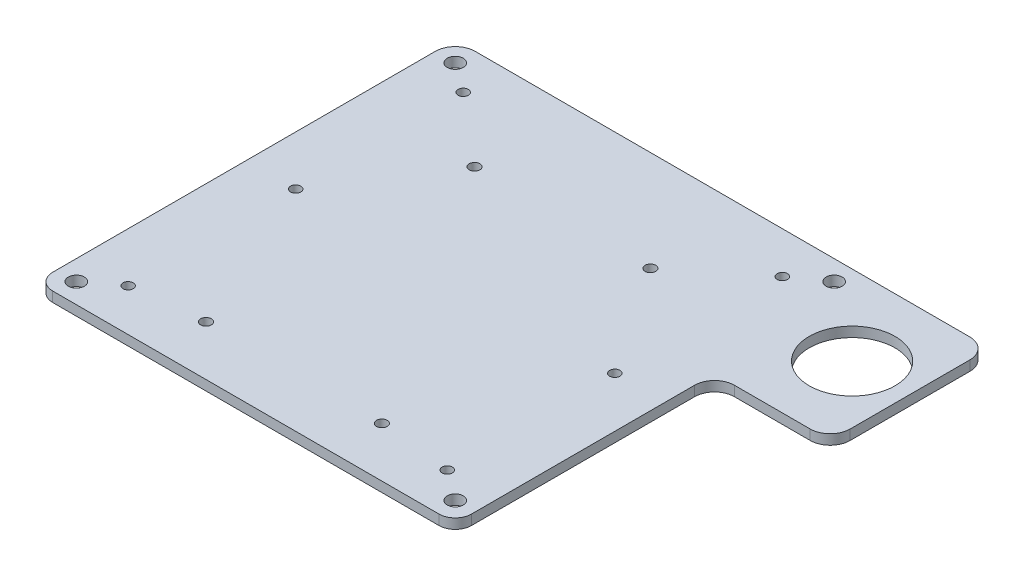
ISO-10303-21;
HEADER;
FILE_DESCRIPTION(('STEP AP214'),'2;1');
FILE_NAME('part.step','',(''),(''),'','','');
FILE_SCHEMA(('AUTOMOTIVE_DESIGN { 1 0 10303 214 1 1 1 1 }'));
ENDSEC;
DATA;
#1=APPLICATION_CONTEXT('core data for automotive mechanical design processes');
#2=APPLICATION_PROTOCOL_DEFINITION('international standard','automotive_design',2000,#1);
#3=PRODUCT_CONTEXT('',#1,'mechanical');
#4=PRODUCT('Part','Part','',(#3));
#5=PRODUCT_RELATED_PRODUCT_CATEGORY('part','',(#4));
#6=PRODUCT_DEFINITION_FORMATION('','',#4);
#7=PRODUCT_DEFINITION_CONTEXT('part definition',#1,'design');
#8=PRODUCT_DEFINITION('design','',#6,#7);
#9=PRODUCT_DEFINITION_SHAPE('','',#8);
#10=(LENGTH_UNIT() NAMED_UNIT(*) SI_UNIT(.MILLI.,.METRE.));
#11=(NAMED_UNIT(*) PLANE_ANGLE_UNIT() SI_UNIT($,.RADIAN.));
#12=(NAMED_UNIT(*) SI_UNIT($,.STERADIAN.) SOLID_ANGLE_UNIT());
#13=UNCERTAINTY_MEASURE_WITH_UNIT(LENGTH_MEASURE(1.E-05),#10,'distance_accuracy_value','');
#14=(GEOMETRIC_REPRESENTATION_CONTEXT(3) GLOBAL_UNCERTAINTY_ASSIGNED_CONTEXT((#13)) GLOBAL_UNIT_ASSIGNED_CONTEXT((#10,
#11,#12)) REPRESENTATION_CONTEXT('',''));
#15=CARTESIAN_POINT('',(0.,0.,0.));
#16=DIRECTION('',(0.,0.,1.));
#17=DIRECTION('',(1.,0.,0.));
#18=AXIS2_PLACEMENT_3D('',#15,#16,#17);
#19=CARTESIAN_POINT('',(73.025,3.175,-9.52500000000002));
#20=DIRECTION('',(0.,-1.,0.));
#21=DIRECTION('',(0.,0.,-1.));
#22=AXIS2_PLACEMENT_3D('',#19,#20,#21);
#23=CYLINDRICAL_SURFACE('',#22,6.35);
#24=CARTESIAN_POINT('',(73.025,0.,-9.52500000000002));
#25=DIRECTION('',(0.,-1.,0.));
#26=DIRECTION('',(0.,0.,1.));
#27=AXIS2_PLACEMENT_3D('',#24,#25,#26);
#28=CIRCLE('',#27,6.35);
#29=CARTESIAN_POINT('',(66.675,0.,-9.52499999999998));
#30=VERTEX_POINT('',#29);
#31=CARTESIAN_POINT('',(73.0250000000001,0.,-15.875));
#32=VERTEX_POINT('',#31);
#33=EDGE_CURVE('E156',#30,#32,#28,.T.);
#34=ORIENTED_EDGE('',*,*,#33,.T.);
#35=DIRECTION('',(0.,-1.,0.));
#36=VECTOR('',#35,1.);
#37=CARTESIAN_POINT('',(73.0250000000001,3.175,-15.875));
#38=LINE('',#37,#36);
#39=CARTESIAN_POINT('',(73.0250000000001,3.175,-15.875));
#40=VERTEX_POINT('',#39);
#41=EDGE_CURVE('E11',#40,#32,#38,.T.);
#42=ORIENTED_EDGE('',*,*,#41,.F.);
#43=CARTESIAN_POINT('',(73.025,3.175,-9.52500000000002));
#44=DIRECTION('',(0.,-1.,0.));
#45=DIRECTION('',(0.,0.,1.));
#46=AXIS2_PLACEMENT_3D('',#43,#44,#45);
#47=CIRCLE('',#46,6.35);
#48=CARTESIAN_POINT('',(66.675,3.175,-9.52499999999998));
#49=VERTEX_POINT('',#48);
#50=EDGE_CURVE('E179',#49,#40,#47,.T.);
#51=ORIENTED_EDGE('',*,*,#50,.F.);
#52=DIRECTION('',(0.,-1.,0.));
#53=VECTOR('',#52,1.);
#54=CARTESIAN_POINT('',(66.675,3.175,-9.52499999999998));
#55=LINE('',#54,#53);
#56=EDGE_CURVE('E152',#49,#30,#55,.T.);
#57=ORIENTED_EDGE('',*,*,#56,.T.);
#58=EDGE_LOOP('',(#34,#42,#51,#57));
#59=FACE_BOUND('',#58,.T.);
#60=ADVANCED_FACE('F36',(#59),#23,.F.);
#61=CARTESIAN_POINT('',(97.155,3.175,-15.875));
#62=DIRECTION('',(0.,0.,-1.));
#63=DIRECTION('',(-1.,0.,0.));
#64=AXIS2_PLACEMENT_3D('',#61,#62,#63);
#65=PLANE('',#64);
#66=DIRECTION('',(1.,0.,0.));
#67=VECTOR('',#66,1.);
#68=CARTESIAN_POINT('',(97.155,0.,-15.875));
#69=LINE('',#68,#67);
#70=CARTESIAN_POINT('',(97.155,0.,-15.875));
#71=VERTEX_POINT('',#70);
#72=EDGE_CURVE('E159',#32,#71,#69,.T.);
#73=ORIENTED_EDGE('',*,*,#72,.T.);
#74=DIRECTION('',(0.,-1.,0.));
#75=VECTOR('',#74,1.);
#76=CARTESIAN_POINT('',(97.155,3.175,-15.875));
#77=LINE('',#76,#75);
#78=CARTESIAN_POINT('',(97.155,3.175,-15.875));
#79=VERTEX_POINT('',#78);
#80=EDGE_CURVE('E44',#79,#71,#77,.T.);
#81=ORIENTED_EDGE('',*,*,#80,.F.);
#82=DIRECTION('',(1.,0.,0.));
#83=VECTOR('',#82,1.);
#84=CARTESIAN_POINT('',(97.155,3.175,-15.875));
#85=LINE('',#84,#83);
#86=EDGE_CURVE('E107',#40,#79,#85,.T.);
#87=ORIENTED_EDGE('',*,*,#86,.F.);
#88=ORIENTED_EDGE('',*,*,#41,.T.);
#89=EDGE_LOOP('',(#73,#81,#87,#88));
#90=FACE_BOUND('',#89,.T.);
#91=ADVANCED_FACE('F259',(#90),#65,.F.);
#92=CARTESIAN_POINT('',(97.155,3.175,-22.225));
#93=DIRECTION('',(0.,-1.,0.));
#94=DIRECTION('',(0.,0.,-1.));
#95=AXIS2_PLACEMENT_3D('',#92,#93,#94);
#96=CYLINDRICAL_SURFACE('',#95,6.35);
#97=CARTESIAN_POINT('',(97.155,0.,-22.225));
#98=DIRECTION('',(0.,1.,0.));
#99=DIRECTION('',(0.,0.,-1.));
#100=AXIS2_PLACEMENT_3D('',#97,#98,#99);
#101=CIRCLE('',#100,6.35);
#102=CARTESIAN_POINT('',(103.505,0.,-22.225));
#103=VERTEX_POINT('',#102);
#104=EDGE_CURVE('E162',#71,#103,#101,.T.);
#105=ORIENTED_EDGE('',*,*,#104,.T.);
#106=DIRECTION('',(0.,-1.,0.));
#107=VECTOR('',#106,1.);
#108=CARTESIAN_POINT('',(103.505,3.175,-22.225));
#109=LINE('',#108,#107);
#110=CARTESIAN_POINT('',(103.505,3.175,-22.225));
#111=VERTEX_POINT('',#110);
#112=EDGE_CURVE('E198',#111,#103,#109,.T.);
#113=ORIENTED_EDGE('',*,*,#112,.F.);
#114=CARTESIAN_POINT('',(97.155,3.175,-22.225));
#115=DIRECTION('',(0.,1.,0.));
#116=DIRECTION('',(0.,0.,-1.));
#117=AXIS2_PLACEMENT_3D('',#114,#115,#116);
#118=CIRCLE('',#117,6.35);
#119=EDGE_CURVE('E206',#79,#111,#118,.T.);
#120=ORIENTED_EDGE('',*,*,#119,.F.);
#121=ORIENTED_EDGE('',*,*,#80,.T.);
#122=EDGE_LOOP('',(#105,#113,#120,#121));
#123=FACE_BOUND('',#122,.T.);
#124=ADVANCED_FACE('F204',(#123),#96,.T.);
#125=CARTESIAN_POINT('',(103.505,3.175,-60.325));
#126=DIRECTION('',(-1.,0.,0.));
#127=DIRECTION('',(0.,0.,1.));
#128=AXIS2_PLACEMENT_3D('',#125,#126,#127);
#129=PLANE('',#128);
#130=DIRECTION('',(0.,0.,-1.));
#131=VECTOR('',#130,1.);
#132=CARTESIAN_POINT('',(103.505,0.,-60.325));
#133=LINE('',#132,#131);
#134=CARTESIAN_POINT('',(103.505,0.,-60.325));
#135=VERTEX_POINT('',#134);
#136=EDGE_CURVE('E164',#103,#135,#133,.T.);
#137=ORIENTED_EDGE('',*,*,#136,.T.);
#138=DIRECTION('',(0.,-1.,0.));
#139=VECTOR('',#138,1.);
#140=CARTESIAN_POINT('',(103.505,3.175,-60.325));
#141=LINE('',#140,#139);
#142=CARTESIAN_POINT('',(103.505,3.175,-60.325));
#143=VERTEX_POINT('',#142);
#144=EDGE_CURVE('E195',#143,#135,#141,.T.);
#145=ORIENTED_EDGE('',*,*,#144,.F.);
#146=DIRECTION('',(0.,0.,-1.));
#147=VECTOR('',#146,1.);
#148=CARTESIAN_POINT('',(103.505,3.175,-60.325));
#149=LINE('',#148,#147);
#150=EDGE_CURVE('E224',#111,#143,#149,.T.);
#151=ORIENTED_EDGE('',*,*,#150,.F.);
#152=ORIENTED_EDGE('',*,*,#112,.T.);
#153=EDGE_LOOP('',(#137,#145,#151,#152));
#154=FACE_BOUND('',#153,.T.);
#155=ADVANCED_FACE('F215',(#154),#129,.F.);
#156=CARTESIAN_POINT('',(97.155,3.175,-60.325));
#157=DIRECTION('',(0.,-1.,0.));
#158=DIRECTION('',(0.,0.,-1.));
#159=AXIS2_PLACEMENT_3D('',#156,#157,#158);
#160=CYLINDRICAL_SURFACE('',#159,6.35);
#161=CARTESIAN_POINT('',(97.155,0.,-60.325));
#162=DIRECTION('',(0.,1.,0.));
#163=DIRECTION('',(0.,0.,-1.));
#164=AXIS2_PLACEMENT_3D('',#161,#162,#163);
#165=CIRCLE('',#164,6.35);
#166=CARTESIAN_POINT('',(97.155,0.,-66.675));
#167=VERTEX_POINT('',#166);
#168=EDGE_CURVE('E166',#135,#167,#165,.T.);
#169=ORIENTED_EDGE('',*,*,#168,.T.);
#170=DIRECTION('',(0.,-1.,0.));
#171=VECTOR('',#170,1.);
#172=CARTESIAN_POINT('',(97.155,3.175,-66.675));
#173=LINE('',#172,#171);
#174=CARTESIAN_POINT('',(97.155,3.175,-66.675));
#175=VERTEX_POINT('',#174);
#176=EDGE_CURVE('E192',#175,#167,#173,.T.);
#177=ORIENTED_EDGE('',*,*,#176,.F.);
#178=CARTESIAN_POINT('',(97.155,3.175,-60.325));
#179=DIRECTION('',(0.,1.,0.));
#180=DIRECTION('',(0.,0.,-1.));
#181=AXIS2_PLACEMENT_3D('',#178,#179,#180);
#182=CIRCLE('',#181,6.35);
#183=EDGE_CURVE('E221',#143,#175,#182,.T.);
#184=ORIENTED_EDGE('',*,*,#183,.F.);
#185=ORIENTED_EDGE('',*,*,#144,.T.);
#186=EDGE_LOOP('',(#169,#177,#184,#185));
#187=FACE_BOUND('',#186,.T.);
#188=ADVANCED_FACE('F219',(#187),#160,.T.);
#189=CARTESIAN_POINT('',(-60.325,3.175,-66.675));
#190=DIRECTION('',(0.,0.,1.));
#191=DIRECTION('',(1.,0.,0.));
#192=AXIS2_PLACEMENT_3D('',#189,#190,#191);
#193=PLANE('',#192);
#194=DIRECTION('',(-1.,0.,0.));
#195=VECTOR('',#194,1.);
#196=CARTESIAN_POINT('',(-60.325,0.,-66.675));
#197=LINE('',#196,#195);
#198=CARTESIAN_POINT('',(-60.325,0.,-66.675));
#199=VERTEX_POINT('',#198);
#200=EDGE_CURVE('E168',#167,#199,#197,.T.);
#201=ORIENTED_EDGE('',*,*,#200,.T.);
#202=DIRECTION('',(0.,-1.,0.));
#203=VECTOR('',#202,1.);
#204=CARTESIAN_POINT('',(-60.325,3.175,-66.675));
#205=LINE('',#204,#203);
#206=CARTESIAN_POINT('',(-60.325,3.175,-66.675));
#207=VERTEX_POINT('',#206);
#208=EDGE_CURVE('E189',#207,#199,#205,.T.);
#209=ORIENTED_EDGE('',*,*,#208,.F.);
#210=DIRECTION('',(-1.,0.,0.));
#211=VECTOR('',#210,1.);
#212=CARTESIAN_POINT('',(-60.325,3.175,-66.675));
#213=LINE('',#212,#211);
#214=EDGE_CURVE('E223',#175,#207,#213,.T.);
#215=ORIENTED_EDGE('',*,*,#214,.F.);
#216=ORIENTED_EDGE('',*,*,#176,.T.);
#217=EDGE_LOOP('',(#201,#209,#215,#216));
#218=FACE_BOUND('',#217,.T.);
#219=ADVANCED_FACE('F272',(#218),#193,.F.);
#220=CARTESIAN_POINT('',(-60.3250000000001,3.175,-60.325));
#221=DIRECTION('',(0.,-1.,0.));
#222=DIRECTION('',(0.,0.,-1.));
#223=AXIS2_PLACEMENT_3D('',#220,#221,#222);
#224=CYLINDRICAL_SURFACE('',#223,6.35);
#225=CARTESIAN_POINT('',(-60.3250000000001,0.,-60.325));
#226=DIRECTION('',(0.,1.,0.));
#227=DIRECTION('',(0.,0.,1.));
#228=AXIS2_PLACEMENT_3D('',#225,#226,#227);
#229=CIRCLE('',#228,6.35);
#230=CARTESIAN_POINT('',(-66.6750000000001,0.,-60.325));
#231=VERTEX_POINT('',#230);
#232=EDGE_CURVE('E170',#199,#231,#229,.T.);
#233=ORIENTED_EDGE('',*,*,#232,.T.);
#234=DIRECTION('',(0.,-1.,0.));
#235=VECTOR('',#234,1.);
#236=CARTESIAN_POINT('',(-66.6750000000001,3.175,-60.325));
#237=LINE('',#236,#235);
#238=CARTESIAN_POINT('',(-66.6750000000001,3.175,-60.325));
#239=VERTEX_POINT('',#238);
#240=EDGE_CURVE('E186',#239,#231,#237,.T.);
#241=ORIENTED_EDGE('',*,*,#240,.F.);
#242=CARTESIAN_POINT('',(-60.3250000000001,3.175,-60.325));
#243=DIRECTION('',(0.,1.,0.));
#244=DIRECTION('',(0.,0.,1.));
#245=AXIS2_PLACEMENT_3D('',#242,#243,#244);
#246=CIRCLE('',#245,6.35);
#247=EDGE_CURVE('E226',#207,#239,#246,.T.);
#248=ORIENTED_EDGE('',*,*,#247,.F.);
#249=ORIENTED_EDGE('',*,*,#208,.T.);
#250=EDGE_LOOP('',(#233,#241,#248,#249));
#251=FACE_BOUND('',#250,.T.);
#252=ADVANCED_FACE('F275',(#251),#224,.T.);
#253=CARTESIAN_POINT('',(-66.6750000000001,3.175,-60.325));
#254=DIRECTION('',(1.,0.,0.));
#255=DIRECTION('',(0.,0.,-1.));
#256=AXIS2_PLACEMENT_3D('',#253,#254,#255);
#257=PLANE('',#256);
#258=DIRECTION('',(0.,0.,1.));
#259=VECTOR('',#258,1.);
#260=CARTESIAN_POINT('',(-66.6750000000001,0.,-60.325));
#261=LINE('',#260,#259);
#262=CARTESIAN_POINT('',(-66.675,0.,61.4938195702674));
#263=VERTEX_POINT('',#262);
#264=EDGE_CURVE('E172',#231,#263,#261,.T.);
#265=ORIENTED_EDGE('',*,*,#264,.T.);
#266=DIRECTION('',(0.,-1.,0.));
#267=VECTOR('',#266,1.);
#268=CARTESIAN_POINT('',(-66.675,3.175,61.4938195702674));
#269=LINE('',#268,#267);
#270=CARTESIAN_POINT('',(-66.675,3.175,61.4938195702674));
#271=VERTEX_POINT('',#270);
#272=EDGE_CURVE('E183',#271,#263,#269,.T.);
#273=ORIENTED_EDGE('',*,*,#272,.F.);
#274=DIRECTION('',(0.,0.,1.));
#275=VECTOR('',#274,1.);
#276=CARTESIAN_POINT('',(-66.6750000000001,3.175,-60.325));
#277=LINE('',#276,#275);
#278=EDGE_CURVE('E232',#239,#271,#277,.T.);
#279=ORIENTED_EDGE('',*,*,#278,.F.);
#280=ORIENTED_EDGE('',*,*,#240,.T.);
#281=EDGE_LOOP('',(#265,#273,#279,#280));
#282=FACE_BOUND('',#281,.T.);
#283=ADVANCED_FACE('F238',(#282),#257,.F.);
#284=CARTESIAN_POINT('',(-61.4938195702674,3.175,61.4938195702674));
#285=DIRECTION('',(0.,-1.,0.));
#286=DIRECTION('',(0.,0.,-1.));
#287=AXIS2_PLACEMENT_3D('',#284,#285,#286);
#288=CYLINDRICAL_SURFACE('',#287,5.18118042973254);
#289=CARTESIAN_POINT('',(-61.4938195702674,0.,61.4938195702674));
#290=DIRECTION('',(0.,1.,0.));
#291=DIRECTION('',(0.,0.,1.));
#292=AXIS2_PLACEMENT_3D('',#289,#290,#291);
#293=CIRCLE('',#292,5.18118042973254);
#294=CARTESIAN_POINT('',(-61.4938195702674,0.,66.675));
#295=VERTEX_POINT('',#294);
#296=EDGE_CURVE('E174',#263,#295,#293,.T.);
#297=ORIENTED_EDGE('',*,*,#296,.T.);
#298=DIRECTION('',(0.,-1.,0.));
#299=VECTOR('',#298,1.);
#300=CARTESIAN_POINT('',(-61.4938195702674,3.175,66.675));
#301=LINE('',#300,#299);
#302=CARTESIAN_POINT('',(-61.4938195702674,3.175,66.675));
#303=VERTEX_POINT('',#302);
#304=EDGE_CURVE('E147',#303,#295,#301,.T.);
#305=ORIENTED_EDGE('',*,*,#304,.F.);
#306=CARTESIAN_POINT('',(-61.4938195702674,3.175,61.4938195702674));
#307=DIRECTION('',(0.,1.,0.));
#308=DIRECTION('',(0.,0.,1.));
#309=AXIS2_PLACEMENT_3D('',#306,#307,#308);
#310=CIRCLE('',#309,5.18118042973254);
#311=EDGE_CURVE('E138',#271,#303,#310,.T.);
#312=ORIENTED_EDGE('',*,*,#311,.F.);
#313=ORIENTED_EDGE('',*,*,#272,.T.);
#314=EDGE_LOOP('',(#297,#305,#312,#313));
#315=FACE_BOUND('',#314,.T.);
#316=ADVANCED_FACE('F242',(#315),#288,.T.);
#317=CARTESIAN_POINT('',(-61.4938195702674,3.175,66.675));
#318=DIRECTION('',(0.,0.,-1.));
#319=DIRECTION('',(-1.,0.,0.));
#320=AXIS2_PLACEMENT_3D('',#317,#318,#319);
#321=PLANE('',#320);
#322=DIRECTION('',(1.,0.,0.));
#323=VECTOR('',#322,1.);
#324=CARTESIAN_POINT('',(-61.4938195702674,0.,66.675));
#325=LINE('',#324,#323);
#326=CARTESIAN_POINT('',(61.4938195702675,0.,66.675));
#327=VERTEX_POINT('',#326);
#328=EDGE_CURVE('E146',#295,#327,#325,.T.);
#329=ORIENTED_EDGE('',*,*,#328,.T.);
#330=DIRECTION('',(0.,-1.,0.));
#331=VECTOR('',#330,1.);
#332=CARTESIAN_POINT('',(61.4938195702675,3.175,66.675));
#333=LINE('',#332,#331);
#334=CARTESIAN_POINT('',(61.4938195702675,3.175,66.675));
#335=VERTEX_POINT('',#334);
#336=EDGE_CURVE('E143',#335,#327,#333,.T.);
#337=ORIENTED_EDGE('',*,*,#336,.F.);
#338=DIRECTION('',(1.,0.,0.));
#339=VECTOR('',#338,1.);
#340=CARTESIAN_POINT('',(-61.4938195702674,3.175,66.675));
#341=LINE('',#340,#339);
#342=EDGE_CURVE('E132',#303,#335,#341,.T.);
#343=ORIENTED_EDGE('',*,*,#342,.F.);
#344=ORIENTED_EDGE('',*,*,#304,.T.);
#345=EDGE_LOOP('',(#329,#337,#343,#344));
#346=FACE_BOUND('',#345,.T.);
#347=ADVANCED_FACE('F144',(#346),#321,.F.);
#348=CARTESIAN_POINT('',(61.4938195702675,3.175,61.4938195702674));
#349=DIRECTION('',(0.,-1.,0.));
#350=DIRECTION('',(0.,0.,-1.));
#351=AXIS2_PLACEMENT_3D('',#348,#349,#350);
#352=CYLINDRICAL_SURFACE('',#351,5.18118042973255);
#353=CARTESIAN_POINT('',(61.4938195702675,0.,61.4938195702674));
#354=DIRECTION('',(0.,1.,0.));
#355=DIRECTION('',(0.,0.,1.));
#356=AXIS2_PLACEMENT_3D('',#353,#354,#355);
#357=CIRCLE('',#356,5.18118042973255);
#358=CARTESIAN_POINT('',(66.675,0.,61.4938195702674));
#359=VERTEX_POINT('',#358);
#360=EDGE_CURVE('E93',#327,#359,#357,.T.);
#361=ORIENTED_EDGE('',*,*,#360,.T.);
#362=DIRECTION('',(0.,-1.,0.));
#363=VECTOR('',#362,1.);
#364=CARTESIAN_POINT('',(66.675,3.175,61.4938195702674));
#365=LINE('',#364,#363);
#366=CARTESIAN_POINT('',(66.675,3.175,61.4938195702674));
#367=VERTEX_POINT('',#366);
#368=EDGE_CURVE('E148',#367,#359,#365,.T.);
#369=ORIENTED_EDGE('',*,*,#368,.F.);
#370=CARTESIAN_POINT('',(61.4938195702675,3.175,61.4938195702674));
#371=DIRECTION('',(0.,1.,0.));
#372=DIRECTION('',(0.,0.,1.));
#373=AXIS2_PLACEMENT_3D('',#370,#371,#372);
#374=CIRCLE('',#373,5.18118042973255);
#375=EDGE_CURVE('E136',#335,#367,#374,.T.);
#376=ORIENTED_EDGE('',*,*,#375,.F.);
#377=ORIENTED_EDGE('',*,*,#336,.T.);
#378=EDGE_LOOP('',(#361,#369,#376,#377));
#379=FACE_BOUND('',#378,.T.);
#380=ADVANCED_FACE('F150',(#379),#352,.T.);
#381=CARTESIAN_POINT('',(66.675,3.175,-9.52499999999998));
#382=DIRECTION('',(-1.,0.,0.));
#383=DIRECTION('',(0.,0.,1.));
#384=AXIS2_PLACEMENT_3D('',#381,#382,#383);
#385=PLANE('',#384);
#386=DIRECTION('',(0.,0.,-1.));
#387=VECTOR('',#386,1.);
#388=CARTESIAN_POINT('',(66.675,0.,-9.52499999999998));
#389=LINE('',#388,#387);
#390=EDGE_CURVE('E99',#359,#30,#389,.T.);
#391=ORIENTED_EDGE('',*,*,#390,.T.);
#392=ORIENTED_EDGE('',*,*,#56,.F.);
#393=DIRECTION('',(0.,0.,-1.));
#394=VECTOR('',#393,1.);
#395=CARTESIAN_POINT('',(66.675,3.175,-9.52499999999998));
#396=LINE('',#395,#394);
#397=EDGE_CURVE('E52',#367,#49,#396,.T.);
#398=ORIENTED_EDGE('',*,*,#397,.F.);
#399=ORIENTED_EDGE('',*,*,#368,.T.);
#400=EDGE_LOOP('',(#391,#392,#398,#399));
#401=FACE_BOUND('',#400,.T.);
#402=ADVANCED_FACE('F246',(#401),#385,.F.);
#403=CARTESIAN_POINT('',(73.025,3.175,-9.52500000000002));
#404=DIRECTION('',(0.,1.,0.));
#405=DIRECTION('',(0.,0.,1.));
#406=AXIS2_PLACEMENT_3D('',#403,#404,#405);
#407=PLANE('',#406);
#408=CARTESIAN_POINT('',(85.09,3.175,-41.275));
#409=DIRECTION('',(0.,1.,0.));
#410=DIRECTION('',(0.,0.,1.));
#411=AXIS2_PLACEMENT_3D('',#408,#409,#410);
#412=CIRCLE('',#411,13.6525);
#413=CARTESIAN_POINT('',(85.09,3.175,-27.6225));
#414=VERTEX_POINT('',#413);
#415=EDGE_CURVE('E466',#414,#414,#412,.T.);
#416=ORIENTED_EDGE('',*,*,#415,.F.);
#417=EDGE_LOOP('',(#416));
#418=FACE_BOUND('',#417,.T.);
#419=CARTESIAN_POINT('',(-50.927,3.175,53.213));
#420=DIRECTION('',(0.,-1.,0.));
#421=DIRECTION('',(0.,0.,-1.));
#422=AXIS2_PLACEMENT_3D('',#419,#420,#421);
#423=CIRCLE('',#422,1.63195);
#424=CARTESIAN_POINT('',(-50.927,3.175,51.58105));
#425=VERTEX_POINT('',#424);
#426=EDGE_CURVE('E473',#425,#425,#423,.T.);
#427=ORIENTED_EDGE('',*,*,#426,.T.);
#428=EDGE_LOOP('',(#427));
#429=FACE_BOUND('',#428,.T.);
#430=CARTESIAN_POINT('',(50.673,3.175,53.213));
#431=DIRECTION('',(0.,-1.,0.));
#432=DIRECTION('',(0.,0.,-1.));
#433=AXIS2_PLACEMENT_3D('',#430,#431,#432);
#434=CIRCLE('',#433,1.63195);
#435=CARTESIAN_POINT('',(50.673,3.175,51.58105));
#436=VERTEX_POINT('',#435);
#437=EDGE_CURVE('E479',#436,#436,#434,.T.);
#438=ORIENTED_EDGE('',*,*,#437,.T.);
#439=EDGE_LOOP('',(#438));
#440=FACE_BOUND('',#439,.T.);
#441=CARTESIAN_POINT('',(50.673,3.175,-53.467));
#442=DIRECTION('',(0.,-1.,0.));
#443=DIRECTION('',(0.,0.,-1.));
#444=AXIS2_PLACEMENT_3D('',#441,#442,#443);
#445=CIRCLE('',#444,1.63195);
#446=CARTESIAN_POINT('',(50.673,3.175,-55.09895));
#447=VERTEX_POINT('',#446);
#448=EDGE_CURVE('E485',#447,#447,#445,.T.);
#449=ORIENTED_EDGE('',*,*,#448,.T.);
#450=EDGE_LOOP('',(#449));
#451=FACE_BOUND('',#450,.T.);
#452=CARTESIAN_POINT('',(-50.927,3.175,-53.467));
#453=DIRECTION('',(0.,-1.,0.));
#454=DIRECTION('',(0.,0.,-1.));
#455=AXIS2_PLACEMENT_3D('',#452,#453,#454);
#456=CIRCLE('',#455,1.63195);
#457=CARTESIAN_POINT('',(-50.927,3.175,-55.09895));
#458=VERTEX_POINT('',#457);
#459=EDGE_CURVE('E491',#458,#458,#456,.T.);
#460=ORIENTED_EDGE('',*,*,#459,.T.);
#461=EDGE_LOOP('',(#460));
#462=FACE_BOUND('',#461,.T.);
#463=CARTESIAN_POINT('',(-50.927,3.175,-0.127000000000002));
#464=DIRECTION('',(0.,-1.,0.));
#465=DIRECTION('',(0.,0.,-1.));
#466=AXIS2_PLACEMENT_3D('',#463,#464,#465);
#467=CIRCLE('',#466,1.63195);
#468=CARTESIAN_POINT('',(-50.927,3.175,-1.75895));
#469=VERTEX_POINT('',#468);
#470=EDGE_CURVE('E497',#469,#469,#467,.T.);
#471=ORIENTED_EDGE('',*,*,#470,.T.);
#472=EDGE_LOOP('',(#471));
#473=FACE_BOUND('',#472,.T.);
#474=CARTESIAN_POINT('',(50.673,3.175,-0.127000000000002));
#475=DIRECTION('',(0.,-1.,0.));
#476=DIRECTION('',(0.,0.,-1.));
#477=AXIS2_PLACEMENT_3D('',#474,#475,#476);
#478=CIRCLE('',#477,1.63195);
#479=CARTESIAN_POINT('',(50.673,3.175,-1.75895));
#480=VERTEX_POINT('',#479);
#481=EDGE_CURVE('E503',#480,#480,#478,.T.);
#482=ORIENTED_EDGE('',*,*,#481,.T.);
#483=EDGE_LOOP('',(#482));
#484=FACE_BOUND('',#483,.T.);
#485=CARTESIAN_POINT('',(-60.325,3.175,-60.325));
#486=DIRECTION('',(0.,1.,0.));
#487=DIRECTION('',(0.,0.,1.));
#488=AXIS2_PLACEMENT_3D('',#485,#486,#487);
#489=CIRCLE('',#488,2.5527);
#490=CARTESIAN_POINT('',(-60.325,3.175,-57.7723));
#491=VERTEX_POINT('',#490);
#492=EDGE_CURVE('E506',#491,#491,#489,.T.);
#493=ORIENTED_EDGE('',*,*,#492,.F.);
#494=EDGE_LOOP('',(#493));
#495=FACE_BOUND('',#494,.T.);
#496=CARTESIAN_POINT('',(60.325,3.175,-60.325));
#497=DIRECTION('',(0.,1.,0.));
#498=DIRECTION('',(0.,0.,1.));
#499=AXIS2_PLACEMENT_3D('',#496,#497,#498);
#500=CIRCLE('',#499,2.5527);
#501=CARTESIAN_POINT('',(60.325,3.175,-57.7723));
#502=VERTEX_POINT('',#501);
#503=EDGE_CURVE('E512',#502,#502,#500,.T.);
#504=ORIENTED_EDGE('',*,*,#503,.F.);
#505=EDGE_LOOP('',(#504));
#506=FACE_BOUND('',#505,.T.);
#507=CARTESIAN_POINT('',(60.3250000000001,3.175,60.325));
#508=DIRECTION('',(0.,1.,0.));
#509=DIRECTION('',(0.,0.,1.));
#510=AXIS2_PLACEMENT_3D('',#507,#508,#509);
#511=CIRCLE('',#510,2.5527);
#512=CARTESIAN_POINT('',(60.3250000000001,3.175,62.8777));
#513=VERTEX_POINT('',#512);
#514=EDGE_CURVE('E518',#513,#513,#511,.T.);
#515=ORIENTED_EDGE('',*,*,#514,.F.);
#516=EDGE_LOOP('',(#515));
#517=FACE_BOUND('',#516,.T.);
#518=CARTESIAN_POINT('',(-60.325,3.175,60.325));
#519=DIRECTION('',(0.,1.,0.));
#520=DIRECTION('',(0.,0.,1.));
#521=AXIS2_PLACEMENT_3D('',#518,#519,#520);
#522=CIRCLE('',#521,2.5527);
#523=CARTESIAN_POINT('',(-60.325,3.175,62.8777));
#524=VERTEX_POINT('',#523);
#525=EDGE_CURVE('E524',#524,#524,#522,.T.);
#526=ORIENTED_EDGE('',*,*,#525,.F.);
#527=EDGE_LOOP('',(#526));
#528=FACE_BOUND('',#527,.T.);
#529=CARTESIAN_POINT('',(-28.5897,3.175,-34.73479995));
#530=DIRECTION('',(0.,-1.,0.));
#531=DIRECTION('',(0.,0.,-1.));
#532=AXIS2_PLACEMENT_3D('',#529,#530,#531);
#533=CIRCLE('',#532,1.7);
#534=CARTESIAN_POINT('',(-28.5897,3.175,-36.43479995));
#535=VERTEX_POINT('',#534);
#536=EDGE_CURVE('E533',#535,#535,#533,.T.);
#537=ORIENTED_EDGE('',*,*,#536,.T.);
#538=EDGE_LOOP('',(#537));
#539=FACE_BOUND('',#538,.T.);
#540=CARTESIAN_POINT('',(27.4103,3.175,-34.73479995));
#541=DIRECTION('',(0.,-1.,0.));
#542=DIRECTION('',(0.,0.,-1.));
#543=AXIS2_PLACEMENT_3D('',#540,#541,#542);
#544=CIRCLE('',#543,1.7);
#545=CARTESIAN_POINT('',(27.4103,3.175,-36.43479995));
#546=VERTEX_POINT('',#545);
#547=EDGE_CURVE('E539',#546,#546,#544,.T.);
#548=ORIENTED_EDGE('',*,*,#547,.T.);
#549=EDGE_LOOP('',(#548));
#550=FACE_BOUND('',#549,.T.);
#551=CARTESIAN_POINT('',(-28.5897,3.175,50.76520005));
#552=DIRECTION('',(0.,-1.,0.));
#553=DIRECTION('',(0.,0.,-1.));
#554=AXIS2_PLACEMENT_3D('',#551,#552,#553);
#555=CIRCLE('',#554,1.7);
#556=CARTESIAN_POINT('',(-28.5897,3.175,49.06520005));
#557=VERTEX_POINT('',#556);
#558=EDGE_CURVE('E545',#557,#557,#555,.T.);
#559=ORIENTED_EDGE('',*,*,#558,.T.);
#560=EDGE_LOOP('',(#559));
#561=FACE_BOUND('',#560,.T.);
#562=CARTESIAN_POINT('',(27.4103,3.175,50.76520005));
#563=DIRECTION('',(0.,-1.,0.));
#564=DIRECTION('',(0.,0.,-1.));
#565=AXIS2_PLACEMENT_3D('',#562,#563,#564);
#566=CIRCLE('',#565,1.7);
#567=CARTESIAN_POINT('',(27.4103,3.175,49.06520005));
#568=VERTEX_POINT('',#567);
#569=EDGE_CURVE('E160',#568,#568,#566,.T.);
#570=ORIENTED_EDGE('',*,*,#569,.T.);
#571=EDGE_LOOP('',(#570));
#572=FACE_BOUND('',#571,.T.);
#573=ORIENTED_EDGE('',*,*,#50,.T.);
#574=ORIENTED_EDGE('',*,*,#86,.T.);
#575=ORIENTED_EDGE('',*,*,#119,.T.);
#576=ORIENTED_EDGE('',*,*,#150,.T.);
#577=ORIENTED_EDGE('',*,*,#183,.T.);
#578=ORIENTED_EDGE('',*,*,#214,.T.);
#579=ORIENTED_EDGE('',*,*,#247,.T.);
#580=ORIENTED_EDGE('',*,*,#278,.T.);
#581=ORIENTED_EDGE('',*,*,#311,.T.);
#582=ORIENTED_EDGE('',*,*,#342,.T.);
#583=ORIENTED_EDGE('',*,*,#375,.T.);
#584=ORIENTED_EDGE('',*,*,#397,.T.);
#585=EDGE_LOOP('',(#573,#574,#575,#576,#577,#578,#579,#580,#581,#582,#583,#584));
#586=FACE_BOUND('',#585,.T.);
#587=ADVANCED_FACE('F134',(#418,#429,#440,#451,#462,#473,#484,#495,#506,#517,#528,#539,#550,
#561,#572,#586),#407,.T.);
#588=CARTESIAN_POINT('',(73.025,0.,-9.52500000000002));
#589=DIRECTION('',(0.,1.,0.));
#590=DIRECTION('',(0.,0.,1.));
#591=AXIS2_PLACEMENT_3D('',#588,#589,#590);
#592=PLANE('',#591);
#593=CARTESIAN_POINT('',(85.09,0.,-41.275));
#594=DIRECTION('',(0.,1.,0.));
#595=DIRECTION('',(0.,0.,1.));
#596=AXIS2_PLACEMENT_3D('',#593,#594,#595);
#597=CIRCLE('',#596,13.6525);
#598=CARTESIAN_POINT('',(85.09,0.,-27.6225));
#599=VERTEX_POINT('',#598);
#600=EDGE_CURVE('E463',#599,#599,#597,.T.);
#601=ORIENTED_EDGE('',*,*,#600,.T.);
#602=EDGE_LOOP('',(#601));
#603=FACE_BOUND('',#602,.T.);
#604=CARTESIAN_POINT('',(-50.927,0.,53.213));
#605=DIRECTION('',(0.,-1.,0.));
#606=DIRECTION('',(0.,0.,-1.));
#607=AXIS2_PLACEMENT_3D('',#604,#605,#606);
#608=CIRCLE('',#607,1.63195);
#609=CARTESIAN_POINT('',(-50.927,0.,51.58105));
#610=VERTEX_POINT('',#609);
#611=EDGE_CURVE('E468',#610,#610,#608,.T.);
#612=ORIENTED_EDGE('',*,*,#611,.F.);
#613=EDGE_LOOP('',(#612));
#614=FACE_BOUND('',#613,.T.);
#615=CARTESIAN_POINT('',(50.673,0.,53.213));
#616=DIRECTION('',(0.,-1.,0.));
#617=DIRECTION('',(0.,0.,-1.));
#618=AXIS2_PLACEMENT_3D('',#615,#616,#617);
#619=CIRCLE('',#618,1.63195);
#620=CARTESIAN_POINT('',(50.673,0.,51.58105));
#621=VERTEX_POINT('',#620);
#622=EDGE_CURVE('E476',#621,#621,#619,.T.);
#623=ORIENTED_EDGE('',*,*,#622,.F.);
#624=EDGE_LOOP('',(#623));
#625=FACE_BOUND('',#624,.T.);
#626=CARTESIAN_POINT('',(50.673,0.,-53.467));
#627=DIRECTION('',(0.,-1.,0.));
#628=DIRECTION('',(0.,0.,-1.));
#629=AXIS2_PLACEMENT_3D('',#626,#627,#628);
#630=CIRCLE('',#629,1.63195);
#631=CARTESIAN_POINT('',(50.673,0.,-55.09895));
#632=VERTEX_POINT('',#631);
#633=EDGE_CURVE('E482',#632,#632,#630,.T.);
#634=ORIENTED_EDGE('',*,*,#633,.F.);
#635=EDGE_LOOP('',(#634));
#636=FACE_BOUND('',#635,.T.);
#637=CARTESIAN_POINT('',(-50.927,0.,-53.467));
#638=DIRECTION('',(0.,-1.,0.));
#639=DIRECTION('',(0.,0.,-1.));
#640=AXIS2_PLACEMENT_3D('',#637,#638,#639);
#641=CIRCLE('',#640,1.63195);
#642=CARTESIAN_POINT('',(-50.927,0.,-55.09895));
#643=VERTEX_POINT('',#642);
#644=EDGE_CURVE('E488',#643,#643,#641,.T.);
#645=ORIENTED_EDGE('',*,*,#644,.F.);
#646=EDGE_LOOP('',(#645));
#647=FACE_BOUND('',#646,.T.);
#648=CARTESIAN_POINT('',(-50.927,0.,-0.127000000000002));
#649=DIRECTION('',(0.,-1.,0.));
#650=DIRECTION('',(0.,0.,-1.));
#651=AXIS2_PLACEMENT_3D('',#648,#649,#650);
#652=CIRCLE('',#651,1.63195);
#653=CARTESIAN_POINT('',(-50.927,0.,-1.75895));
#654=VERTEX_POINT('',#653);
#655=EDGE_CURVE('E494',#654,#654,#652,.T.);
#656=ORIENTED_EDGE('',*,*,#655,.F.);
#657=EDGE_LOOP('',(#656));
#658=FACE_BOUND('',#657,.T.);
#659=CARTESIAN_POINT('',(50.673,0.,-0.127000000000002));
#660=DIRECTION('',(0.,-1.,0.));
#661=DIRECTION('',(0.,0.,-1.));
#662=AXIS2_PLACEMENT_3D('',#659,#660,#661);
#663=CIRCLE('',#662,1.63195);
#664=CARTESIAN_POINT('',(50.673,0.,-1.75895));
#665=VERTEX_POINT('',#664);
#666=EDGE_CURVE('E500',#665,#665,#663,.T.);
#667=ORIENTED_EDGE('',*,*,#666,.F.);
#668=EDGE_LOOP('',(#667));
#669=FACE_BOUND('',#668,.T.);
#670=CARTESIAN_POINT('',(-60.325,0.,-60.325));
#671=DIRECTION('',(0.,1.,0.));
#672=DIRECTION('',(0.,0.,1.));
#673=AXIS2_PLACEMENT_3D('',#670,#671,#672);
#674=CIRCLE('',#673,2.5527);
#675=CARTESIAN_POINT('',(-60.325,0.,-57.7723));
#676=VERTEX_POINT('',#675);
#677=EDGE_CURVE('E509',#676,#676,#674,.T.);
#678=ORIENTED_EDGE('',*,*,#677,.T.);
#679=EDGE_LOOP('',(#678));
#680=FACE_BOUND('',#679,.T.);
#681=CARTESIAN_POINT('',(60.325,0.,-60.325));
#682=DIRECTION('',(0.,1.,0.));
#683=DIRECTION('',(0.,0.,1.));
#684=AXIS2_PLACEMENT_3D('',#681,#682,#683);
#685=CIRCLE('',#684,2.5527);
#686=CARTESIAN_POINT('',(60.325,0.,-57.7723));
#687=VERTEX_POINT('',#686);
#688=EDGE_CURVE('E515',#687,#687,#685,.T.);
#689=ORIENTED_EDGE('',*,*,#688,.T.);
#690=EDGE_LOOP('',(#689));
#691=FACE_BOUND('',#690,.T.);
#692=CARTESIAN_POINT('',(60.3250000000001,0.,60.325));
#693=DIRECTION('',(0.,1.,0.));
#694=DIRECTION('',(0.,0.,1.));
#695=AXIS2_PLACEMENT_3D('',#692,#693,#694);
#696=CIRCLE('',#695,2.5527);
#697=CARTESIAN_POINT('',(60.3250000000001,0.,62.8777));
#698=VERTEX_POINT('',#697);
#699=EDGE_CURVE('E521',#698,#698,#696,.T.);
#700=ORIENTED_EDGE('',*,*,#699,.T.);
#701=EDGE_LOOP('',(#700));
#702=FACE_BOUND('',#701,.T.);
#703=CARTESIAN_POINT('',(-60.325,0.,60.325));
#704=DIRECTION('',(0.,1.,0.));
#705=DIRECTION('',(0.,0.,1.));
#706=AXIS2_PLACEMENT_3D('',#703,#704,#705);
#707=CIRCLE('',#706,2.5527);
#708=CARTESIAN_POINT('',(-60.325,0.,62.8777));
#709=VERTEX_POINT('',#708);
#710=EDGE_CURVE('E527',#709,#709,#707,.T.);
#711=ORIENTED_EDGE('',*,*,#710,.T.);
#712=EDGE_LOOP('',(#711));
#713=FACE_BOUND('',#712,.T.);
#714=CARTESIAN_POINT('',(-28.5897,0.,-34.73479995));
#715=DIRECTION('',(0.,-1.,0.));
#716=DIRECTION('',(0.,0.,-1.));
#717=AXIS2_PLACEMENT_3D('',#714,#715,#716);
#718=CIRCLE('',#717,1.7);
#719=CARTESIAN_POINT('',(-28.5897,0.,-36.43479995));
#720=VERTEX_POINT('',#719);
#721=EDGE_CURVE('E530',#720,#720,#718,.T.);
#722=ORIENTED_EDGE('',*,*,#721,.F.);
#723=EDGE_LOOP('',(#722));
#724=FACE_BOUND('',#723,.T.);
#725=CARTESIAN_POINT('',(27.4103,0.,-34.73479995));
#726=DIRECTION('',(0.,-1.,0.));
#727=DIRECTION('',(0.,0.,-1.));
#728=AXIS2_PLACEMENT_3D('',#725,#726,#727);
#729=CIRCLE('',#728,1.7);
#730=CARTESIAN_POINT('',(27.4103,0.,-36.43479995));
#731=VERTEX_POINT('',#730);
#732=EDGE_CURVE('E536',#731,#731,#729,.T.);
#733=ORIENTED_EDGE('',*,*,#732,.F.);
#734=EDGE_LOOP('',(#733));
#735=FACE_BOUND('',#734,.T.);
#736=CARTESIAN_POINT('',(-28.5897,0.,50.76520005));
#737=DIRECTION('',(0.,-1.,0.));
#738=DIRECTION('',(0.,0.,-1.));
#739=AXIS2_PLACEMENT_3D('',#736,#737,#738);
#740=CIRCLE('',#739,1.7);
#741=CARTESIAN_POINT('',(-28.5897,0.,49.06520005));
#742=VERTEX_POINT('',#741);
#743=EDGE_CURVE('E542',#742,#742,#740,.T.);
#744=ORIENTED_EDGE('',*,*,#743,.F.);
#745=EDGE_LOOP('',(#744));
#746=FACE_BOUND('',#745,.T.);
#747=CARTESIAN_POINT('',(27.4103,0.,50.76520005));
#748=DIRECTION('',(0.,-1.,0.));
#749=DIRECTION('',(0.,0.,-1.));
#750=AXIS2_PLACEMENT_3D('',#747,#748,#749);
#751=CIRCLE('',#750,1.7);
#752=CARTESIAN_POINT('',(27.4103,0.,49.06520005));
#753=VERTEX_POINT('',#752);
#754=EDGE_CURVE('E548',#753,#753,#751,.T.);
#755=ORIENTED_EDGE('',*,*,#754,.F.);
#756=EDGE_LOOP('',(#755));
#757=FACE_BOUND('',#756,.T.);
#758=ORIENTED_EDGE('',*,*,#33,.F.);
#759=ORIENTED_EDGE('',*,*,#390,.F.);
#760=ORIENTED_EDGE('',*,*,#360,.F.);
#761=ORIENTED_EDGE('',*,*,#328,.F.);
#762=ORIENTED_EDGE('',*,*,#296,.F.);
#763=ORIENTED_EDGE('',*,*,#264,.F.);
#764=ORIENTED_EDGE('',*,*,#232,.F.);
#765=ORIENTED_EDGE('',*,*,#200,.F.);
#766=ORIENTED_EDGE('',*,*,#168,.F.);
#767=ORIENTED_EDGE('',*,*,#136,.F.);
#768=ORIENTED_EDGE('',*,*,#104,.F.);
#769=ORIENTED_EDGE('',*,*,#72,.F.);
#770=EDGE_LOOP('',(#758,#759,#760,#761,#762,#763,#764,#765,#766,#767,#768,#769));
#771=FACE_BOUND('',#770,.T.);
#772=ADVANCED_FACE('F210',(#603,#614,#625,#636,#647,#658,#669,#680,#691,#702,#713,#724,#735,
#746,#757,#771),#592,.F.);
#773=CARTESIAN_POINT('',(27.4103,0.,50.76520005));
#774=DIRECTION('',(0.,-1.,0.));
#775=DIRECTION('',(0.,0.,-1.));
#776=AXIS2_PLACEMENT_3D('',#773,#774,#775);
#777=CYLINDRICAL_SURFACE('',#776,1.7);
#778=ORIENTED_EDGE('',*,*,#569,.F.);
#779=EDGE_LOOP('',(#778));
#780=FACE_BOUND('',#779,.T.);
#781=ORIENTED_EDGE('',*,*,#754,.T.);
#782=EDGE_LOOP('',(#781));
#783=FACE_BOUND('',#782,.T.);
#784=ADVANCED_FACE('F303',(#780,#783),#777,.F.);
#785=CARTESIAN_POINT('',(-28.5897,0.,50.76520005));
#786=DIRECTION('',(0.,-1.,0.));
#787=DIRECTION('',(0.,0.,-1.));
#788=AXIS2_PLACEMENT_3D('',#785,#786,#787);
#789=CYLINDRICAL_SURFACE('',#788,1.7);
#790=ORIENTED_EDGE('',*,*,#558,.F.);
#791=EDGE_LOOP('',(#790));
#792=FACE_BOUND('',#791,.T.);
#793=ORIENTED_EDGE('',*,*,#743,.T.);
#794=EDGE_LOOP('',(#793));
#795=FACE_BOUND('',#794,.T.);
#796=ADVANCED_FACE('F308',(#792,#795),#789,.F.);
#797=CARTESIAN_POINT('',(27.4103,0.,-34.73479995));
#798=DIRECTION('',(0.,-1.,0.));
#799=DIRECTION('',(0.,0.,-1.));
#800=AXIS2_PLACEMENT_3D('',#797,#798,#799);
#801=CYLINDRICAL_SURFACE('',#800,1.7);
#802=ORIENTED_EDGE('',*,*,#547,.F.);
#803=EDGE_LOOP('',(#802));
#804=FACE_BOUND('',#803,.T.);
#805=ORIENTED_EDGE('',*,*,#732,.T.);
#806=EDGE_LOOP('',(#805));
#807=FACE_BOUND('',#806,.T.);
#808=ADVANCED_FACE('F320',(#804,#807),#801,.F.);
#809=CARTESIAN_POINT('',(-28.5897,0.,-34.73479995));
#810=DIRECTION('',(0.,-1.,0.));
#811=DIRECTION('',(0.,0.,-1.));
#812=AXIS2_PLACEMENT_3D('',#809,#810,#811);
#813=CYLINDRICAL_SURFACE('',#812,1.7);
#814=ORIENTED_EDGE('',*,*,#536,.F.);
#815=EDGE_LOOP('',(#814));
#816=FACE_BOUND('',#815,.T.);
#817=ORIENTED_EDGE('',*,*,#721,.T.);
#818=EDGE_LOOP('',(#817));
#819=FACE_BOUND('',#818,.T.);
#820=ADVANCED_FACE('F330',(#816,#819),#813,.F.);
#821=CARTESIAN_POINT('',(-60.325,3.175,60.325));
#822=DIRECTION('',(0.,1.,0.));
#823=DIRECTION('',(0.,0.,1.));
#824=AXIS2_PLACEMENT_3D('',#821,#822,#823);
#825=CYLINDRICAL_SURFACE('',#824,2.5527);
#826=ORIENTED_EDGE('',*,*,#710,.F.);
#827=EDGE_LOOP('',(#826));
#828=FACE_BOUND('',#827,.T.);
#829=ORIENTED_EDGE('',*,*,#525,.T.);
#830=EDGE_LOOP('',(#829));
#831=FACE_BOUND('',#830,.T.);
#832=ADVANCED_FACE('F340',(#828,#831),#825,.F.);
#833=CARTESIAN_POINT('',(60.3250000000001,3.175,60.325));
#834=DIRECTION('',(0.,1.,0.));
#835=DIRECTION('',(0.,0.,1.));
#836=AXIS2_PLACEMENT_3D('',#833,#834,#835);
#837=CYLINDRICAL_SURFACE('',#836,2.5527);
#838=ORIENTED_EDGE('',*,*,#699,.F.);
#839=EDGE_LOOP('',(#838));
#840=FACE_BOUND('',#839,.T.);
#841=ORIENTED_EDGE('',*,*,#514,.T.);
#842=EDGE_LOOP('',(#841));
#843=FACE_BOUND('',#842,.T.);
#844=ADVANCED_FACE('F350',(#840,#843),#837,.F.);
#845=CARTESIAN_POINT('',(60.325,3.175,-60.325));
#846=DIRECTION('',(0.,1.,0.));
#847=DIRECTION('',(0.,0.,1.));
#848=AXIS2_PLACEMENT_3D('',#845,#846,#847);
#849=CYLINDRICAL_SURFACE('',#848,2.5527);
#850=ORIENTED_EDGE('',*,*,#688,.F.);
#851=EDGE_LOOP('',(#850));
#852=FACE_BOUND('',#851,.T.);
#853=ORIENTED_EDGE('',*,*,#503,.T.);
#854=EDGE_LOOP('',(#853));
#855=FACE_BOUND('',#854,.T.);
#856=ADVANCED_FACE('F360',(#852,#855),#849,.F.);
#857=CARTESIAN_POINT('',(-60.325,3.175,-60.325));
#858=DIRECTION('',(0.,1.,0.));
#859=DIRECTION('',(0.,0.,1.));
#860=AXIS2_PLACEMENT_3D('',#857,#858,#859);
#861=CYLINDRICAL_SURFACE('',#860,2.5527);
#862=ORIENTED_EDGE('',*,*,#677,.F.);
#863=EDGE_LOOP('',(#862));
#864=FACE_BOUND('',#863,.T.);
#865=ORIENTED_EDGE('',*,*,#492,.T.);
#866=EDGE_LOOP('',(#865));
#867=FACE_BOUND('',#866,.T.);
#868=ADVANCED_FACE('F370',(#864,#867),#861,.F.);
#869=CARTESIAN_POINT('',(50.673,0.,-0.127000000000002));
#870=DIRECTION('',(0.,-1.,0.));
#871=DIRECTION('',(0.,0.,-1.));
#872=AXIS2_PLACEMENT_3D('',#869,#870,#871);
#873=CYLINDRICAL_SURFACE('',#872,1.63195);
#874=ORIENTED_EDGE('',*,*,#481,.F.);
#875=EDGE_LOOP('',(#874));
#876=FACE_BOUND('',#875,.T.);
#877=ORIENTED_EDGE('',*,*,#666,.T.);
#878=EDGE_LOOP('',(#877));
#879=FACE_BOUND('',#878,.T.);
#880=ADVANCED_FACE('F380',(#876,#879),#873,.F.);
#881=CARTESIAN_POINT('',(-50.927,0.,-0.127000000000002));
#882=DIRECTION('',(0.,-1.,0.));
#883=DIRECTION('',(0.,0.,-1.));
#884=AXIS2_PLACEMENT_3D('',#881,#882,#883);
#885=CYLINDRICAL_SURFACE('',#884,1.63195);
#886=ORIENTED_EDGE('',*,*,#470,.F.);
#887=EDGE_LOOP('',(#886));
#888=FACE_BOUND('',#887,.T.);
#889=ORIENTED_EDGE('',*,*,#655,.T.);
#890=EDGE_LOOP('',(#889));
#891=FACE_BOUND('',#890,.T.);
#892=ADVANCED_FACE('F390',(#888,#891),#885,.F.);
#893=CARTESIAN_POINT('',(-50.927,0.,-53.467));
#894=DIRECTION('',(0.,-1.,0.));
#895=DIRECTION('',(0.,0.,-1.));
#896=AXIS2_PLACEMENT_3D('',#893,#894,#895);
#897=CYLINDRICAL_SURFACE('',#896,1.63195);
#898=ORIENTED_EDGE('',*,*,#459,.F.);
#899=EDGE_LOOP('',(#898));
#900=FACE_BOUND('',#899,.T.);
#901=ORIENTED_EDGE('',*,*,#644,.T.);
#902=EDGE_LOOP('',(#901));
#903=FACE_BOUND('',#902,.T.);
#904=ADVANCED_FACE('F400',(#900,#903),#897,.F.);
#905=CARTESIAN_POINT('',(50.673,0.,-53.467));
#906=DIRECTION('',(0.,-1.,0.));
#907=DIRECTION('',(0.,0.,-1.));
#908=AXIS2_PLACEMENT_3D('',#905,#906,#907);
#909=CYLINDRICAL_SURFACE('',#908,1.63195);
#910=ORIENTED_EDGE('',*,*,#448,.F.);
#911=EDGE_LOOP('',(#910));
#912=FACE_BOUND('',#911,.T.);
#913=ORIENTED_EDGE('',*,*,#633,.T.);
#914=EDGE_LOOP('',(#913));
#915=FACE_BOUND('',#914,.T.);
#916=ADVANCED_FACE('F410',(#912,#915),#909,.F.);
#917=CARTESIAN_POINT('',(50.673,0.,53.213));
#918=DIRECTION('',(0.,-1.,0.));
#919=DIRECTION('',(0.,0.,-1.));
#920=AXIS2_PLACEMENT_3D('',#917,#918,#919);
#921=CYLINDRICAL_SURFACE('',#920,1.63195);
#922=ORIENTED_EDGE('',*,*,#437,.F.);
#923=EDGE_LOOP('',(#922));
#924=FACE_BOUND('',#923,.T.);
#925=ORIENTED_EDGE('',*,*,#622,.T.);
#926=EDGE_LOOP('',(#925));
#927=FACE_BOUND('',#926,.T.);
#928=ADVANCED_FACE('F420',(#924,#927),#921,.F.);
#929=CARTESIAN_POINT('',(-50.927,0.,53.213));
#930=DIRECTION('',(0.,-1.,0.));
#931=DIRECTION('',(0.,0.,-1.));
#932=AXIS2_PLACEMENT_3D('',#929,#930,#931);
#933=CYLINDRICAL_SURFACE('',#932,1.63195);
#934=ORIENTED_EDGE('',*,*,#426,.F.);
#935=EDGE_LOOP('',(#934));
#936=FACE_BOUND('',#935,.T.);
#937=ORIENTED_EDGE('',*,*,#611,.T.);
#938=EDGE_LOOP('',(#937));
#939=FACE_BOUND('',#938,.T.);
#940=ADVANCED_FACE('F430',(#936,#939),#933,.F.);
#941=CARTESIAN_POINT('',(85.09,0.,-41.275));
#942=DIRECTION('',(0.,1.,0.));
#943=DIRECTION('',(0.,0.,1.));
#944=AXIS2_PLACEMENT_3D('',#941,#942,#943);
#945=CYLINDRICAL_SURFACE('',#944,13.6525);
#946=ORIENTED_EDGE('',*,*,#600,.F.);
#947=EDGE_LOOP('',(#946));
#948=FACE_BOUND('',#947,.T.);
#949=ORIENTED_EDGE('',*,*,#415,.T.);
#950=EDGE_LOOP('',(#949));
#951=FACE_BOUND('',#950,.T.);
#952=ADVANCED_FACE('F439',(#948,#951),#945,.F.);
#953=CLOSED_SHELL('',(#60,#91,#124,#155,#188,#219,#252,#283,#316,#347,#380,#402,#587,#772,#784,
#796,#808,#820,#832,#844,#856,#868,#880,#892,#904,#916,#928,#940,#952));
#954=MANIFOLD_SOLID_BREP('B2',#953);
#955=ADVANCED_BREP_SHAPE_REPRESENTATION('',(#18,#954),#14);
#956=SHAPE_DEFINITION_REPRESENTATION(#9,#955);
ENDSEC;
END-ISO-10303-21;
